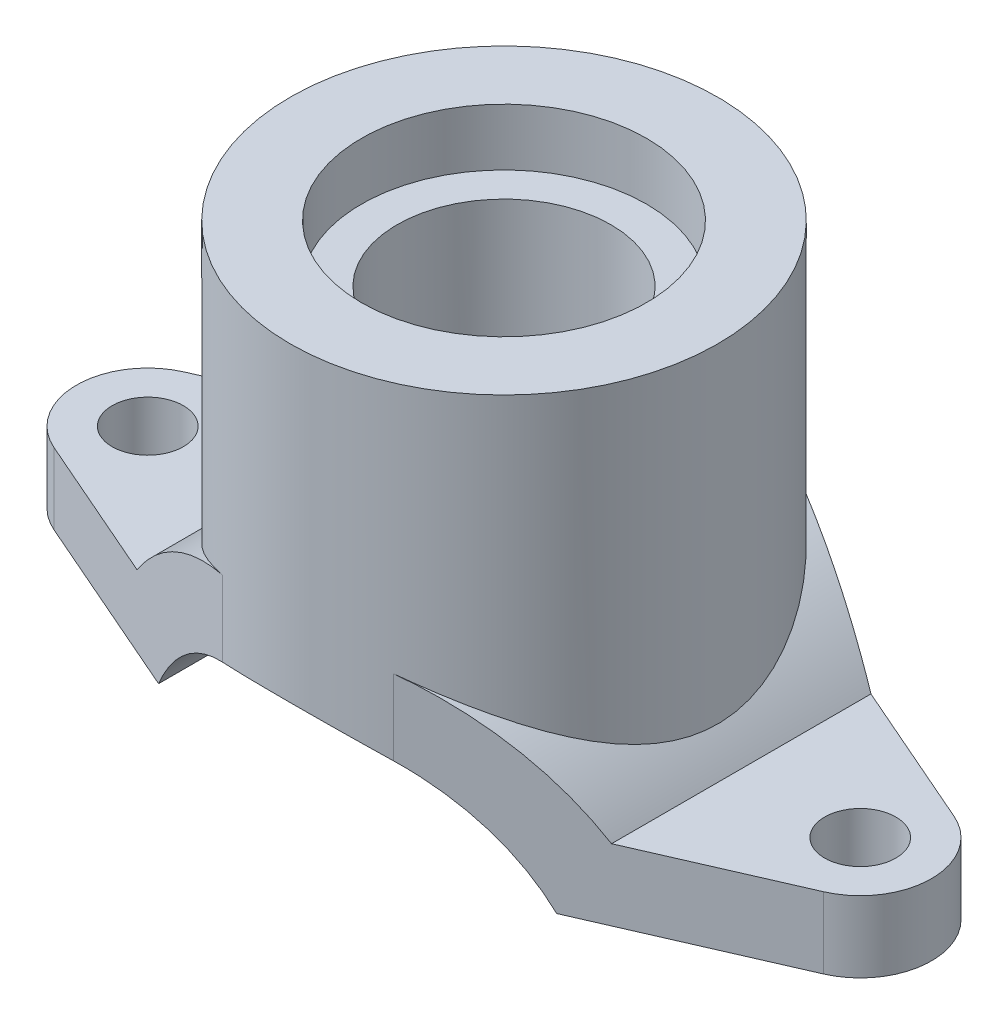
from build123d import *

# Parameters (mm, degrees)
EXTRUDE1_DEPTH    = 75
SKETCH2_OUTSIDE_W = 370.368
SKETCH2_OUTSIDE_H = 220.368
EXTRUDE2_DEPTH    = 223.162102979
EXTRUDE3_REACH    = 227
SKETCH3_R         = 75
SKETCH5_R         = 12.5
EXTRUDE4_DEPTH    = 210.165006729


with BuildPart() as part:
    # Sketch1 → Extrude1 (new, symmetric)
    with BuildSketch(Plane.XY):
        with BuildLine():
            Line((-69.84983894, 0), (-150, 0))
            Line((-150, 0), (-150, 25))
            Line((-150, 25), (-83.240615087, 25))
            ThreePointArc((-83.240615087, 25), (0, 66), (83.240615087, 25))
            Line((83.240615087, 25), (150, 25))
            Line((150, 25), (150, 0))
            Line((150, 0), (69.84983894, 0))
            ThreePointArc((69.84983894, 0), (0, 41), (-69.84983894, 0))
        make_face()
    extrude(amount=EXTRUDE1_DEPTH, both=True)

    # Sketch2 outside → Extrude2 (cut, through all)
    with BuildSketch(Plane(origin=(0, 66, 75), x_dir=(-1, 0, 0), z_dir=(0, 1, 0))):
        with Locations((0, -75)):
            Rectangle(SKETCH2_OUTSIDE_W, SKETCH2_OUTSIDE_H)
        with BuildLine():
            Line((-135, -52.087121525), (-30, -6.261364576))
            ThreePointArc((-30, -6.261364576), (0, 0), (30, -6.261364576))
            Line((30, -6.261364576), (135, -52.087121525))
            ThreePointArc((135, -52.087121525), (150, -75), (135, -97.912878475))
            Line((135, -97.912878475), (30, -143.738635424))
            ThreePointArc((30, -143.738635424), (0, -150), (-30, -143.738635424))
            Line((-30, -143.738635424), (-135, -97.912878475))
            ThreePointArc((-135, -97.912878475), (-150, -75), (-135, -52.087121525))
        make_face(mode=Mode.SUBTRACT)
    extrude(amount=-EXTRUDE2_DEPTH, mode=Mode.SUBTRACT)

    # Sketch3 → Extrude3 (add, up to next)
    with BuildSketch(Plane(origin=(0, 150, 0), x_dir=(-1, 0, 0), z_dir=(0, 1, 0)), mode=Mode.PRIVATE) as extrude3_sk1:
        with Locations(Location((0, 0, 0), (0, 0, 293.578178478))):
            Circle(SKETCH3_R)
    extrude3_tool1 = extrude(extrude3_sk1.sketch, amount=-EXTRUDE3_REACH, mode=Mode.PRIVATE) - part.part
    add(extrude3_tool1.solids().sort_by_distance((0, 150, 0))[0])

    # Sketch4 → Cut-Revolve1 (revolve, cut)
    with BuildSketch(Plane.XY, mode=Mode.PRIVATE) as cut_revolve1_sk:
        Polygon((0, 20), (0, 150), (50, 150), (50, 130), (37.5, 130), (37.5, 20), align=None)
    revolve(cut_revolve1_sk.sketch.rotate(Axis((0, 0, 0), (0, 1, 0)), 90), axis=Axis((0, 0, 0), (0, 1, 0)), mode=Mode.SUBTRACT)

    # Sketch5 → Extrude4 (cut, through all)
    with BuildSketch(Plane(origin=(0, 25, 0), x_dir=(1, 0, 0), z_dir=(0, 1, 0))):
        with Locations(Location((-125, 0, 0), (0, 0, 180))):
            Circle(SKETCH5_R)
        with Locations((125, 0)):
            Circle(SKETCH5_R)
    extrude(amount=-EXTRUDE4_DEPTH, mode=Mode.SUBTRACT)


solid = part.part
